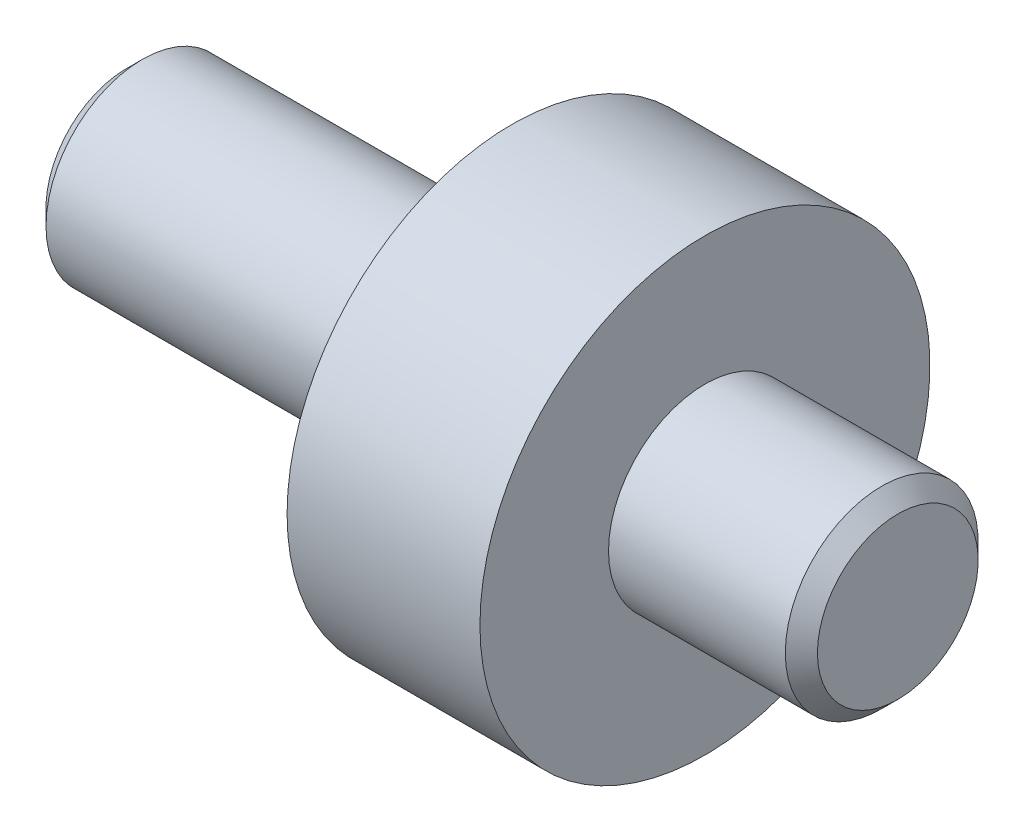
from build123d import *

# Parameters (mm, degrees)
CHANFREIN1_SIZE = 0.5


with BuildPart() as part:
    # Esquisse1 → Base-R_volution (revolve)
    with BuildSketch(Plane.XY, mode=Mode.PRIVATE) as base_r_volution_sk:
        Polygon((0, 0), (0, 3), (12, 3), (12, 7), (18, 7), (18, 3), (24, 3), (24, 0), align=None)
    revolve(base_r_volution_sk.sketch.rotate(Axis((0, 0, 0), (1, 0, 0)), 90), axis=Axis((0, 0, 0), (1, 0, 0)))

    # Chanfrein1
    chanfrein1_edges = [part.edges().sort_by_distance(p)[0] for p in [
        (0, 0, -3),
        (24, 0, -3),
    ]]
    chamfer(chanfrein1_edges, length=CHANFREIN1_SIZE)


solid = part.part
